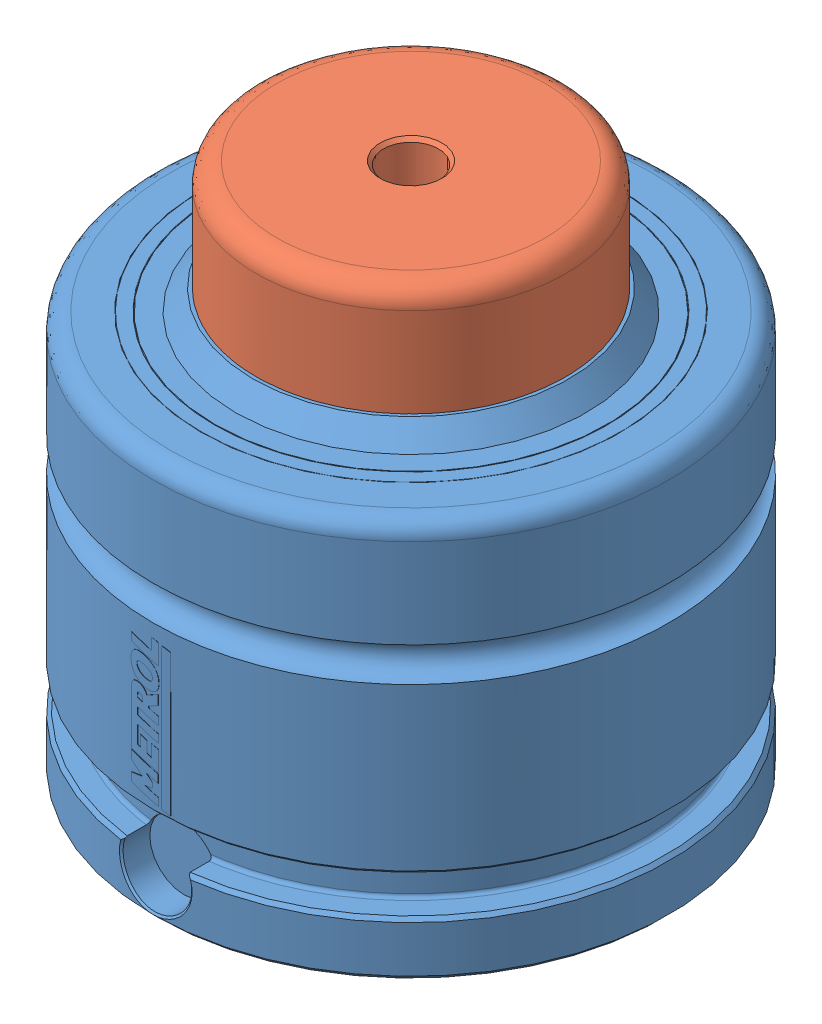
SolidWorks assembly EX-2400-016.SLDASM, configuration Default (file format 7000). Lengths in mm.
Overall size (79.26 77 79.26).
2 component instances, 2 part files, 5 mates.
Components (placement in the parent):
- EX-2400 Body-1: EX-2400 Body.SLDPRT [EX-2500-016] x (0 0 1) z (0 -1 0) size (75.1 75 61)
- EX-2400 Piston-1: EX-2400 Piston.SLDPRT [EX-2500-016] at (0 43 0) x (-0.912902 0 -0.408178) z (0 -1 0) size (60 60 34)
Mates (geometry in assembly coordinates):
- Concentric1: concentric anti-aligned: cylinder of EX-2400 Body-1 through (0 0 0) axis (0 -1 0) radius 22.5; cylinder of EX-2400 Piston-1 through (0 65.6906 0) axis (0 1 0) radius 22.5
- LimitDistance1: limit distance anti-aligned: plane of EX-2400 Piston-1 through (12.2453 48 -27.3871) normal (0 1 0); plane of EX-2400 Body-1 through (-22.5 48 0) normal (0 -1 0)
- Coincident2: coincident aligned: plane of assembly through (0 0 0) normal (0 0 1); plane of EX-2400 Body-1
- Coincident3: coincident anti-aligned: plane of EX-2400 Body-1 through (0 0 0) normal (0 -1 0); plane of assembly through (0 0 0) normal (0 1 0)
- Coincident4: coincident anti-aligned: plane of EX-2400 Body-1; plane of assembly through (0 0 0) normal (1 0 0)
